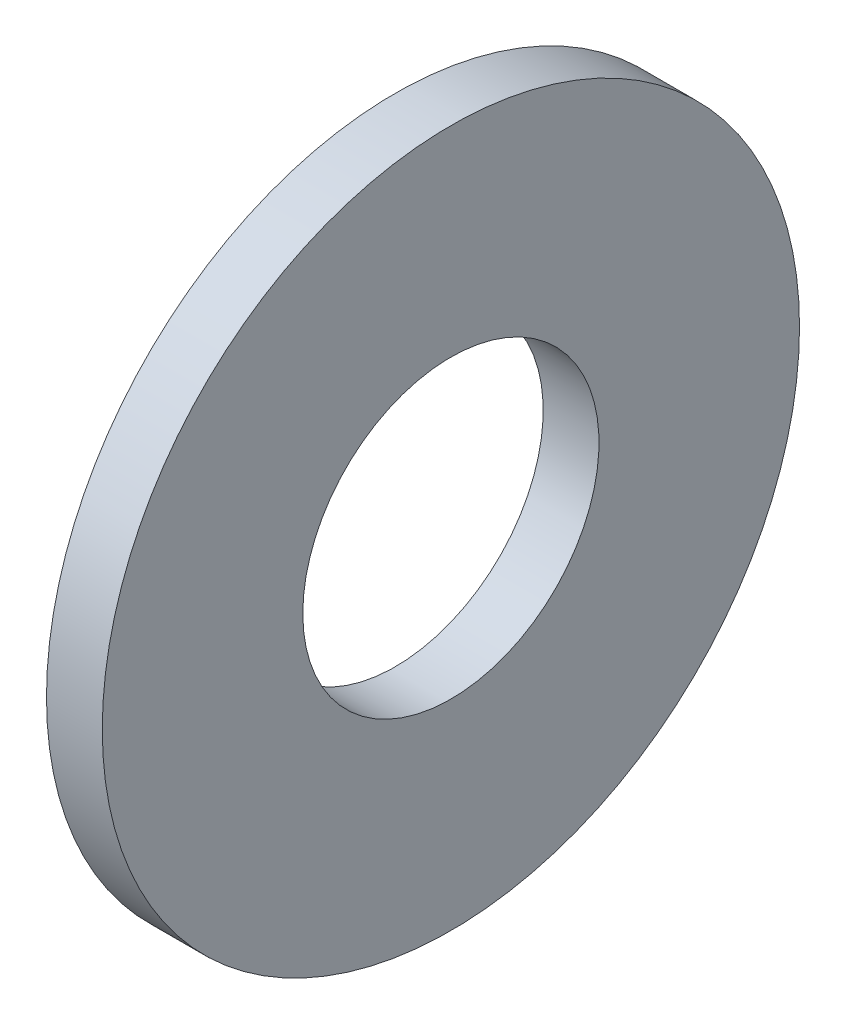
ISO-10303-21;
HEADER;
FILE_DESCRIPTION(('STEP AP214'),'2;1');
FILE_NAME('part.step','',(''),(''),'','','');
FILE_SCHEMA(('AUTOMOTIVE_DESIGN { 1 0 10303 214 1 1 1 1 }'));
ENDSEC;
DATA;
#1=APPLICATION_CONTEXT('core data for automotive mechanical design processes');
#2=APPLICATION_PROTOCOL_DEFINITION('international standard','automotive_design',2000,#1);
#3=PRODUCT_CONTEXT('',#1,'mechanical');
#4=PRODUCT('Part','Part','',(#3));
#5=PRODUCT_RELATED_PRODUCT_CATEGORY('part','',(#4));
#6=PRODUCT_DEFINITION_FORMATION('','',#4);
#7=PRODUCT_DEFINITION_CONTEXT('part definition',#1,'design');
#8=PRODUCT_DEFINITION('design','',#6,#7);
#9=PRODUCT_DEFINITION_SHAPE('','',#8);
#10=(LENGTH_UNIT() NAMED_UNIT(*) SI_UNIT(.MILLI.,.METRE.));
#11=(NAMED_UNIT(*) PLANE_ANGLE_UNIT() SI_UNIT($,.RADIAN.));
#12=(NAMED_UNIT(*) SI_UNIT($,.STERADIAN.) SOLID_ANGLE_UNIT());
#13=UNCERTAINTY_MEASURE_WITH_UNIT(LENGTH_MEASURE(1.E-05),#10,'distance_accuracy_value','');
#14=(GEOMETRIC_REPRESENTATION_CONTEXT(3) GLOBAL_UNCERTAINTY_ASSIGNED_CONTEXT((#13)) GLOBAL_UNIT_ASSIGNED_CONTEXT((#10,
#11,#12)) REPRESENTATION_CONTEXT('',''));
#15=CARTESIAN_POINT('',(0.,0.,0.));
#16=DIRECTION('',(0.,0.,1.));
#17=DIRECTION('',(1.,0.,0.));
#18=AXIS2_PLACEMENT_3D('',#15,#16,#17);
#19=CARTESIAN_POINT('',(-34.9249999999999,0.,0.));
#20=DIRECTION('',(-1.,0.,0.));
#21=DIRECTION('',(0.,0.,1.));
#22=AXIS2_PLACEMENT_3D('',#19,#20,#21);
#23=CYLINDRICAL_SURFACE('',#22,6.7437);
#24=CARTESIAN_POINT('',(0.,0.,0.));
#25=DIRECTION('',(-1.,0.,0.));
#26=DIRECTION('',(0.,0.,1.));
#27=AXIS2_PLACEMENT_3D('',#24,#25,#26);
#28=CIRCLE('',#27,6.7437);
#29=CARTESIAN_POINT('',(0.,0.,6.7437));
#30=VERTEX_POINT('',#29);
#31=EDGE_CURVE('E10',#30,#30,#28,.T.);
#32=ORIENTED_EDGE('',*,*,#31,.F.);
#33=EDGE_LOOP('',(#32));
#34=FACE_BOUND('',#33,.T.);
#35=CARTESIAN_POINT('',(-2.54,0.,0.));
#36=DIRECTION('',(-1.,0.,0.));
#37=DIRECTION('',(0.,0.,1.));
#38=AXIS2_PLACEMENT_3D('',#35,#36,#37);
#39=CIRCLE('',#38,6.7437);
#40=CARTESIAN_POINT('',(-2.54,0.,6.7437));
#41=VERTEX_POINT('',#40);
#42=EDGE_CURVE('E42',#41,#41,#39,.T.);
#43=ORIENTED_EDGE('',*,*,#42,.T.);
#44=EDGE_LOOP('',(#43));
#45=FACE_BOUND('',#44,.T.);
#46=ADVANCED_FACE('F28',(#34,#45),#23,.F.);
#47=CARTESIAN_POINT('',(0.,6.7437,0.));
#48=DIRECTION('',(-1.,0.,0.));
#49=DIRECTION('',(0.,0.,1.));
#50=AXIS2_PLACEMENT_3D('',#47,#48,#49);
#51=PLANE('',#50);
#52=CARTESIAN_POINT('',(0.,0.,0.));
#53=DIRECTION('',(-1.,0.,0.));
#54=DIRECTION('',(0.,0.,1.));
#55=AXIS2_PLACEMENT_3D('',#52,#53,#54);
#56=CIRCLE('',#55,15.875);
#57=CARTESIAN_POINT('',(0.,0.,15.875));
#58=VERTEX_POINT('',#57);
#59=EDGE_CURVE('E34',#58,#58,#56,.T.);
#60=ORIENTED_EDGE('',*,*,#59,.F.);
#61=EDGE_LOOP('',(#60));
#62=FACE_BOUND('',#61,.T.);
#63=ORIENTED_EDGE('',*,*,#31,.T.);
#64=EDGE_LOOP('',(#63));
#65=FACE_BOUND('',#64,.T.);
#66=ADVANCED_FACE('F57',(#62,#65),#51,.F.);
#67=CARTESIAN_POINT('',(-34.9249999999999,0.,0.));
#68=DIRECTION('',(-1.,0.,0.));
#69=DIRECTION('',(0.,0.,1.));
#70=AXIS2_PLACEMENT_3D('',#67,#68,#69);
#71=CYLINDRICAL_SURFACE('',#70,15.875);
#72=CARTESIAN_POINT('',(-2.54,0.,0.));
#73=DIRECTION('',(-1.,0.,0.));
#74=DIRECTION('',(0.,0.,1.));
#75=AXIS2_PLACEMENT_3D('',#72,#73,#74);
#76=CIRCLE('',#75,15.875);
#77=CARTESIAN_POINT('',(-2.54,0.,15.875));
#78=VERTEX_POINT('',#77);
#79=EDGE_CURVE('E38',#78,#78,#76,.T.);
#80=ORIENTED_EDGE('',*,*,#79,.F.);
#81=EDGE_LOOP('',(#80));
#82=FACE_BOUND('',#81,.T.);
#83=ORIENTED_EDGE('',*,*,#59,.T.);
#84=EDGE_LOOP('',(#83));
#85=FACE_BOUND('',#84,.T.);
#86=ADVANCED_FACE('F52',(#82,#85),#71,.T.);
#87=CARTESIAN_POINT('',(-2.54,15.875,0.));
#88=DIRECTION('',(1.,0.,0.));
#89=DIRECTION('',(0.,0.,-1.));
#90=AXIS2_PLACEMENT_3D('',#87,#88,#89);
#91=PLANE('',#90);
#92=ORIENTED_EDGE('',*,*,#42,.F.);
#93=EDGE_LOOP('',(#92));
#94=FACE_BOUND('',#93,.T.);
#95=ORIENTED_EDGE('',*,*,#79,.T.);
#96=EDGE_LOOP('',(#95));
#97=FACE_BOUND('',#96,.T.);
#98=ADVANCED_FACE('F49',(#94,#97),#91,.F.);
#99=CLOSED_SHELL('',(#46,#66,#86,#98));
#100=MANIFOLD_SOLID_BREP('B2',#99);
#101=ADVANCED_BREP_SHAPE_REPRESENTATION('',(#18,#100),#14);
#102=SHAPE_DEFINITION_REPRESENTATION(#9,#101);
ENDSEC;
END-ISO-10303-21;
